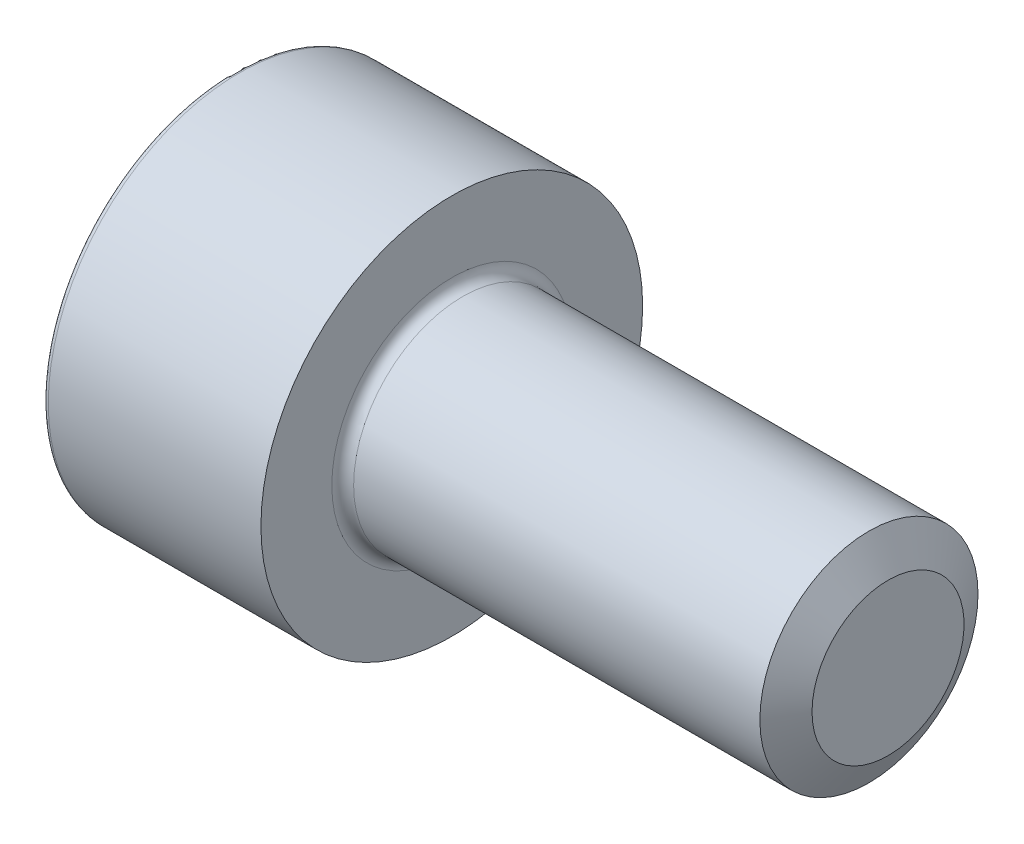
ISO-10303-21;
HEADER;
FILE_DESCRIPTION(('STEP AP214'),'2;1');
FILE_NAME('part.step','',(''),(''),'','','');
FILE_SCHEMA(('AUTOMOTIVE_DESIGN { 1 0 10303 214 1 1 1 1 }'));
ENDSEC;
DATA;
#1=APPLICATION_CONTEXT('core data for automotive mechanical design processes');
#2=APPLICATION_PROTOCOL_DEFINITION('international standard','automotive_design',2000,#1);
#3=PRODUCT_CONTEXT('',#1,'mechanical');
#4=PRODUCT('Part','Part','',(#3));
#5=PRODUCT_RELATED_PRODUCT_CATEGORY('part','',(#4));
#6=PRODUCT_DEFINITION_FORMATION('','',#4);
#7=PRODUCT_DEFINITION_CONTEXT('part definition',#1,'design');
#8=PRODUCT_DEFINITION('design','',#6,#7);
#9=PRODUCT_DEFINITION_SHAPE('','',#8);
#10=(LENGTH_UNIT() NAMED_UNIT(*) SI_UNIT(.MILLI.,.METRE.));
#11=(NAMED_UNIT(*) PLANE_ANGLE_UNIT() SI_UNIT($,.RADIAN.));
#12=(NAMED_UNIT(*) SI_UNIT($,.STERADIAN.) SOLID_ANGLE_UNIT());
#13=UNCERTAINTY_MEASURE_WITH_UNIT(LENGTH_MEASURE(1.E-05),#10,'distance_accuracy_value','');
#14=(GEOMETRIC_REPRESENTATION_CONTEXT(3) GLOBAL_UNCERTAINTY_ASSIGNED_CONTEXT((#13)) GLOBAL_UNIT_ASSIGNED_CONTEXT((#10,
#11,#12)) REPRESENTATION_CONTEXT('',''));
#15=CARTESIAN_POINT('',(0.,0.,0.));
#16=DIRECTION('',(0.,0.,1.));
#17=DIRECTION('',(1.,0.,0.));
#18=AXIS2_PLACEMENT_3D('',#15,#16,#17);
#19=CARTESIAN_POINT('',(12.,2.,0.));
#20=DIRECTION('',(-1.,0.,0.));
#21=DIRECTION('',(0.,0.,1.));
#22=AXIS2_PLACEMENT_3D('',#19,#20,#21);
#23=PLANE('',#22);
#24=CARTESIAN_POINT('',(12.,0.,0.));
#25=DIRECTION('',(-1.,0.,0.));
#26=DIRECTION('',(0.,0.,1.));
#27=AXIS2_PLACEMENT_3D('',#24,#25,#26);
#28=CIRCLE('',#27,1.3938);
#29=CARTESIAN_POINT('',(12.,0.,1.3938));
#30=VERTEX_POINT('',#29);
#31=EDGE_CURVE('E165',#30,#30,#28,.T.);
#32=ORIENTED_EDGE('',*,*,#31,.F.);
#33=EDGE_LOOP('',(#32));
#34=FACE_BOUND('',#33,.T.);
#35=ADVANCED_FACE('F17',(#34),#23,.F.);
#36=CARTESIAN_POINT('',(2.,1.48956369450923,2.58));
#37=DIRECTION('',(-1.,0.,0.));
#38=DIRECTION('',(0.,0.,1.));
#39=AXIS2_PLACEMENT_3D('',#36,#37,#38);
#40=PLANE('',#39);
#41=DIRECTION('',(0.,0.866025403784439,0.5));
#42=VECTOR('',#41,1.);
#43=CARTESIAN_POINT('',(2.,-1.48956369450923,0.86));
#44=LINE('',#43,#42);
#45=CARTESIAN_POINT('',(2.,-1.48956369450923,0.86));
#46=VERTEX_POINT('',#45);
#47=CARTESIAN_POINT('',(2.,0.,1.72));
#48=VERTEX_POINT('',#47);
#49=EDGE_CURVE('E96',#46,#48,#44,.T.);
#50=ORIENTED_EDGE('',*,*,#49,.T.);
#51=DIRECTION('',(0.,0.866025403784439,-0.5));
#52=VECTOR('',#51,1.);
#53=CARTESIAN_POINT('',(2.,0.,1.72));
#54=LINE('',#53,#52);
#55=CARTESIAN_POINT('',(2.,1.48956369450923,0.86));
#56=VERTEX_POINT('',#55);
#57=EDGE_CURVE('E11',#48,#56,#54,.T.);
#58=ORIENTED_EDGE('',*,*,#57,.T.);
#59=DIRECTION('',(0.,0.,-1.));
#60=VECTOR('',#59,1.);
#61=CARTESIAN_POINT('',(2.,1.48956369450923,0.86));
#62=LINE('',#61,#60);
#63=CARTESIAN_POINT('',(2.,1.48956369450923,-0.86));
#64=VERTEX_POINT('',#63);
#65=EDGE_CURVE('E44',#56,#64,#62,.T.);
#66=ORIENTED_EDGE('',*,*,#65,.T.);
#67=DIRECTION('',(0.,-0.866025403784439,-0.5));
#68=VECTOR('',#67,1.);
#69=CARTESIAN_POINT('',(2.,1.48956369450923,-0.86));
#70=LINE('',#69,#68);
#71=CARTESIAN_POINT('',(2.,0.,-1.72));
#72=VERTEX_POINT('',#71);
#73=EDGE_CURVE('E149',#64,#72,#70,.T.);
#74=ORIENTED_EDGE('',*,*,#73,.T.);
#75=DIRECTION('',(0.,-0.866025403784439,0.5));
#76=VECTOR('',#75,1.);
#77=CARTESIAN_POINT('',(2.,0.,-1.72));
#78=LINE('',#77,#76);
#79=CARTESIAN_POINT('',(2.,-1.48956369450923,-0.86));
#80=VERTEX_POINT('',#79);
#81=EDGE_CURVE('E143',#72,#80,#78,.T.);
#82=ORIENTED_EDGE('',*,*,#81,.T.);
#83=DIRECTION('',(0.,0.,1.));
#84=VECTOR('',#83,1.);
#85=CARTESIAN_POINT('',(2.,-1.48956369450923,-0.86));
#86=LINE('',#85,#84);
#87=EDGE_CURVE('E137',#80,#46,#86,.T.);
#88=ORIENTED_EDGE('',*,*,#87,.T.);
#89=EDGE_LOOP('',(#50,#58,#66,#74,#82,#88));
#90=FACE_BOUND('',#89,.T.);
#91=ADVANCED_FACE('F187',(#90),#40,.T.);
#92=CARTESIAN_POINT('',(2.,0.,1.72));
#93=DIRECTION('',(0.,0.5,0.866025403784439));
#94=DIRECTION('',(1.,0.,0.));
#95=AXIS2_PLACEMENT_3D('',#92,#93,#94);
#96=PLANE('',#95);
#97=DIRECTION('',(0.,0.866025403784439,-0.5));
#98=VECTOR('',#97,1.);
#99=CARTESIAN_POINT('',(0.,0.,1.72));
#100=LINE('',#99,#98);
#101=CARTESIAN_POINT('',(0.,0.,1.72));
#102=VERTEX_POINT('',#101);
#103=CARTESIAN_POINT('',(0.,1.48956369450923,0.86));
#104=VERTEX_POINT('',#103);
#105=EDGE_CURVE('E92',#102,#104,#100,.T.);
#106=ORIENTED_EDGE('',*,*,#105,.T.);
#107=DIRECTION('',(-1.,0.,0.));
#108=VECTOR('',#107,1.);
#109=CARTESIAN_POINT('',(2.,1.48956369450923,0.86));
#110=LINE('',#109,#108);
#111=EDGE_CURVE('E25',#56,#104,#110,.T.);
#112=ORIENTED_EDGE('',*,*,#111,.F.);
#113=ORIENTED_EDGE('',*,*,#57,.F.);
#114=DIRECTION('',(-1.,0.,0.));
#115=VECTOR('',#114,1.);
#116=CARTESIAN_POINT('',(2.,0.,1.72));
#117=LINE('',#116,#115);
#118=EDGE_CURVE('E88',#48,#102,#117,.T.);
#119=ORIENTED_EDGE('',*,*,#118,.T.);
#120=EDGE_LOOP('',(#106,#112,#113,#119));
#121=FACE_BOUND('',#120,.T.);
#122=ADVANCED_FACE('F90',(#121),#96,.F.);
#123=CARTESIAN_POINT('',(2.,1.48956369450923,0.86));
#124=DIRECTION('',(0.,1.,0.));
#125=DIRECTION('',(1.,0.,0.));
#126=AXIS2_PLACEMENT_3D('',#123,#124,#125);
#127=PLANE('',#126);
#128=DIRECTION('',(0.,0.,-1.));
#129=VECTOR('',#128,1.);
#130=CARTESIAN_POINT('',(0.,1.48956369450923,0.86));
#131=LINE('',#130,#129);
#132=CARTESIAN_POINT('',(0.,1.48956369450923,-0.86));
#133=VERTEX_POINT('',#132);
#134=EDGE_CURVE('E97',#104,#133,#131,.T.);
#135=ORIENTED_EDGE('',*,*,#134,.T.);
#136=DIRECTION('',(-1.,0.,0.));
#137=VECTOR('',#136,1.);
#138=CARTESIAN_POINT('',(2.,1.48956369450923,-0.86));
#139=LINE('',#138,#137);
#140=EDGE_CURVE('E151',#64,#133,#139,.T.);
#141=ORIENTED_EDGE('',*,*,#140,.F.);
#142=ORIENTED_EDGE('',*,*,#65,.F.);
#143=ORIENTED_EDGE('',*,*,#111,.T.);
#144=EDGE_LOOP('',(#135,#141,#142,#143));
#145=FACE_BOUND('',#144,.T.);
#146=ADVANCED_FACE('F191',(#145),#127,.F.);
#147=CARTESIAN_POINT('',(2.,1.48956369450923,-0.86));
#148=DIRECTION('',(0.,0.5,-0.866025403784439));
#149=DIRECTION('',(-1.,0.,0.));
#150=AXIS2_PLACEMENT_3D('',#147,#148,#149);
#151=PLANE('',#150);
#152=DIRECTION('',(0.,-0.866025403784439,-0.5));
#153=VECTOR('',#152,1.);
#154=CARTESIAN_POINT('',(0.,1.48956369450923,-0.86));
#155=LINE('',#154,#153);
#156=CARTESIAN_POINT('',(0.,0.,-1.72));
#157=VERTEX_POINT('',#156);
#158=EDGE_CURVE('E131',#133,#157,#155,.T.);
#159=ORIENTED_EDGE('',*,*,#158,.T.);
#160=DIRECTION('',(-1.,0.,0.));
#161=VECTOR('',#160,1.);
#162=CARTESIAN_POINT('',(2.,0.,-1.72));
#163=LINE('',#162,#161);
#164=EDGE_CURVE('E146',#72,#157,#163,.T.);
#165=ORIENTED_EDGE('',*,*,#164,.F.);
#166=ORIENTED_EDGE('',*,*,#73,.F.);
#167=ORIENTED_EDGE('',*,*,#140,.T.);
#168=EDGE_LOOP('',(#159,#165,#166,#167));
#169=FACE_BOUND('',#168,.T.);
#170=ADVANCED_FACE('F190',(#169),#151,.F.);
#171=CARTESIAN_POINT('',(2.,0.,-1.72));
#172=DIRECTION('',(0.,-0.5,-0.866025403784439));
#173=DIRECTION('',(0.,-0.866025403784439,0.5));
#174=AXIS2_PLACEMENT_3D('',#171,#172,#173);
#175=PLANE('',#174);
#176=DIRECTION('',(0.,-0.866025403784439,0.5));
#177=VECTOR('',#176,1.);
#178=CARTESIAN_POINT('',(0.,0.,-1.72));
#179=LINE('',#178,#177);
#180=CARTESIAN_POINT('',(0.,-1.48956369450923,-0.86));
#181=VERTEX_POINT('',#180);
#182=EDGE_CURVE('E130',#157,#181,#179,.T.);
#183=ORIENTED_EDGE('',*,*,#182,.T.);
#184=DIRECTION('',(-1.,0.,0.));
#185=VECTOR('',#184,1.);
#186=CARTESIAN_POINT('',(2.,-1.48956369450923,-0.86));
#187=LINE('',#186,#185);
#188=EDGE_CURVE('E140',#80,#181,#187,.T.);
#189=ORIENTED_EDGE('',*,*,#188,.F.);
#190=ORIENTED_EDGE('',*,*,#81,.F.);
#191=ORIENTED_EDGE('',*,*,#164,.T.);
#192=EDGE_LOOP('',(#183,#189,#190,#191));
#193=FACE_BOUND('',#192,.T.);
#194=ADVANCED_FACE('F181',(#193),#175,.F.);
#195=CARTESIAN_POINT('',(2.,-1.48956369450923,-0.86));
#196=DIRECTION('',(0.,-1.,0.));
#197=DIRECTION('',(0.,0.,-1.));
#198=AXIS2_PLACEMENT_3D('',#195,#196,#197);
#199=PLANE('',#198);
#200=DIRECTION('',(0.,0.,1.));
#201=VECTOR('',#200,1.);
#202=CARTESIAN_POINT('',(0.,-1.48956369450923,-0.86));
#203=LINE('',#202,#201);
#204=CARTESIAN_POINT('',(0.,-1.48956369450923,0.86));
#205=VERTEX_POINT('',#204);
#206=EDGE_CURVE('E108',#181,#205,#203,.T.);
#207=ORIENTED_EDGE('',*,*,#206,.T.);
#208=DIRECTION('',(-1.,0.,0.));
#209=VECTOR('',#208,1.);
#210=CARTESIAN_POINT('',(2.,-1.48956369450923,0.86));
#211=LINE('',#210,#209);
#212=EDGE_CURVE('E103',#46,#205,#211,.T.);
#213=ORIENTED_EDGE('',*,*,#212,.F.);
#214=ORIENTED_EDGE('',*,*,#87,.F.);
#215=ORIENTED_EDGE('',*,*,#188,.T.);
#216=EDGE_LOOP('',(#207,#213,#214,#215));
#217=FACE_BOUND('',#216,.T.);
#218=ADVANCED_FACE('F186',(#217),#199,.F.);
#219=CARTESIAN_POINT('',(2.,-1.48956369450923,0.86));
#220=DIRECTION('',(0.,-0.5,0.866025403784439));
#221=DIRECTION('',(-1.,0.,0.));
#222=AXIS2_PLACEMENT_3D('',#219,#220,#221);
#223=PLANE('',#222);
#224=DIRECTION('',(0.,0.866025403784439,0.5));
#225=VECTOR('',#224,1.);
#226=CARTESIAN_POINT('',(0.,-1.48956369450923,0.86));
#227=LINE('',#226,#225);
#228=EDGE_CURVE('E100',#205,#102,#227,.T.);
#229=ORIENTED_EDGE('',*,*,#228,.T.);
#230=ORIENTED_EDGE('',*,*,#118,.F.);
#231=ORIENTED_EDGE('',*,*,#49,.F.);
#232=ORIENTED_EDGE('',*,*,#212,.T.);
#233=EDGE_LOOP('',(#229,#230,#231,#232));
#234=FACE_BOUND('',#233,.T.);
#235=ADVANCED_FACE('F101',(#234),#223,.F.);
#236=CARTESIAN_POINT('',(4.,3.5,0.));
#237=DIRECTION('',(-1.,0.,0.));
#238=DIRECTION('',(0.,0.,1.));
#239=AXIS2_PLACEMENT_3D('',#236,#237,#238);
#240=PLANE('',#239);
#241=CARTESIAN_POINT('',(4.,0.,0.));
#242=DIRECTION('',(-1.,0.,0.));
#243=DIRECTION('',(0.,0.,1.));
#244=AXIS2_PLACEMENT_3D('',#241,#242,#243);
#245=CIRCLE('',#244,2.2);
#246=CARTESIAN_POINT('',(4.,0.,2.2));
#247=VERTEX_POINT('',#246);
#248=EDGE_CURVE('E172',#247,#247,#245,.T.);
#249=ORIENTED_EDGE('',*,*,#248,.T.);
#250=EDGE_LOOP('',(#249));
#251=FACE_BOUND('',#250,.T.);
#252=CARTESIAN_POINT('',(4.,0.,0.));
#253=DIRECTION('',(-1.,0.,0.));
#254=DIRECTION('',(0.,0.,1.));
#255=AXIS2_PLACEMENT_3D('',#252,#253,#254);
#256=CIRCLE('',#255,3.5);
#257=CARTESIAN_POINT('',(4.,0.,3.5));
#258=VERTEX_POINT('',#257);
#259=EDGE_CURVE('E116',#258,#258,#256,.T.);
#260=ORIENTED_EDGE('',*,*,#259,.F.);
#261=EDGE_LOOP('',(#260));
#262=FACE_BOUND('',#261,.T.);
#263=ADVANCED_FACE('F430',(#251,#262),#240,.F.);
#264=CARTESIAN_POINT('',(0.,0.,0.));
#265=DIRECTION('',(1.,0.,0.));
#266=DIRECTION('',(0.,1.,0.));
#267=AXIS2_PLACEMENT_3D('',#264,#265,#266);
#268=PLANE('',#267);
#269=ORIENTED_EDGE('',*,*,#105,.F.);
#270=ORIENTED_EDGE('',*,*,#228,.F.);
#271=ORIENTED_EDGE('',*,*,#206,.F.);
#272=ORIENTED_EDGE('',*,*,#182,.F.);
#273=ORIENTED_EDGE('',*,*,#158,.F.);
#274=ORIENTED_EDGE('',*,*,#134,.F.);
#275=EDGE_LOOP('',(#269,#270,#271,#272,#273,#274));
#276=FACE_BOUND('',#275,.T.);
#277=CARTESIAN_POINT('',(0.,0.,0.));
#278=DIRECTION('',(-1.,0.,0.));
#279=DIRECTION('',(0.,0.,-1.));
#280=AXIS2_PLACEMENT_3D('',#277,#278,#279);
#281=CIRCLE('',#280,3.4);
#282=CARTESIAN_POINT('',(0.,0.,-3.4));
#283=VERTEX_POINT('',#282);
#284=EDGE_CURVE('E229',#283,#283,#281,.T.);
#285=ORIENTED_EDGE('',*,*,#284,.T.);
#286=EDGE_LOOP('',(#285));
#287=FACE_BOUND('',#286,.T.);
#288=ADVANCED_FACE('F111',(#276,#287),#268,.F.);
#289=CARTESIAN_POINT('',(0.,0.,0.));
#290=DIRECTION('',(-1.,0.,0.));
#291=DIRECTION('',(0.,0.,1.));
#292=AXIS2_PLACEMENT_3D('',#289,#290,#291);
#293=CYLINDRICAL_SURFACE('',#292,2.);
#294=CARTESIAN_POINT('',(4.2,0.,0.));
#295=DIRECTION('',(-1.,0.,0.));
#296=DIRECTION('',(0.,0.,1.));
#297=AXIS2_PLACEMENT_3D('',#294,#295,#296);
#298=CIRCLE('',#297,2.);
#299=CARTESIAN_POINT('',(4.2,0.,2.));
#300=VERTEX_POINT('',#299);
#301=EDGE_CURVE('E123',#300,#300,#298,.T.);
#302=ORIENTED_EDGE('',*,*,#301,.F.);
#303=EDGE_LOOP('',(#302));
#304=FACE_BOUND('',#303,.T.);
#305=CARTESIAN_POINT('',(11.6500102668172,0.,0.));
#306=DIRECTION('',(-1.,0.,0.));
#307=DIRECTION('',(0.,0.,1.));
#308=AXIS2_PLACEMENT_3D('',#305,#306,#307);
#309=CIRCLE('',#308,2.);
#310=CARTESIAN_POINT('',(11.6500102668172,0.,2.));
#311=VERTEX_POINT('',#310);
#312=EDGE_CURVE('E168',#311,#311,#309,.T.);
#313=ORIENTED_EDGE('',*,*,#312,.T.);
#314=EDGE_LOOP('',(#313));
#315=FACE_BOUND('',#314,.T.);
#316=ADVANCED_FACE('F303',(#304,#315),#293,.T.);
#317=CARTESIAN_POINT('',(0.,0.,0.));
#318=DIRECTION('',(-1.,0.,0.));
#319=DIRECTION('',(0.,0.,1.));
#320=AXIS2_PLACEMENT_3D('',#317,#318,#319);
#321=CYLINDRICAL_SURFACE('',#320,3.5);
#322=CARTESIAN_POINT('',(0.1,0.,0.));
#323=DIRECTION('',(1.,0.,0.));
#324=DIRECTION('',(0.,0.,-1.));
#325=AXIS2_PLACEMENT_3D('',#322,#323,#324);
#326=CIRCLE('',#325,3.5);
#327=CARTESIAN_POINT('',(0.1,0.,-3.5));
#328=VERTEX_POINT('',#327);
#329=EDGE_CURVE('E216',#328,#328,#326,.T.);
#330=ORIENTED_EDGE('',*,*,#329,.T.);
#331=EDGE_LOOP('',(#330));
#332=FACE_BOUND('',#331,.T.);
#333=ORIENTED_EDGE('',*,*,#259,.T.);
#334=EDGE_LOOP('',(#333));
#335=FACE_BOUND('',#334,.T.);
#336=ADVANCED_FACE('F290',(#332,#335),#321,.T.);
#337=CARTESIAN_POINT('',(4.2,0.,0.));
#338=DIRECTION('',(-1.,0.,0.));
#339=DIRECTION('',(0.,0.,1.));
#340=AXIS2_PLACEMENT_3D('',#337,#338,#339);
#341=TOROIDAL_SURFACE('',#340,2.2,0.2);
#342=ORIENTED_EDGE('',*,*,#301,.T.);
#343=EDGE_LOOP('',(#342));
#344=FACE_BOUND('',#343,.T.);
#345=ORIENTED_EDGE('',*,*,#248,.F.);
#346=EDGE_LOOP('',(#345));
#347=FACE_BOUND('',#346,.T.);
#348=ADVANCED_FACE('F277',(#344,#347),#341,.F.);
#349=CARTESIAN_POINT('',(11.6500102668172,0.,0.));
#350=DIRECTION('',(-1.,0.,0.));
#351=DIRECTION('',(0.,0.,1.));
#352=AXIS2_PLACEMENT_3D('',#349,#350,#351);
#353=CONICAL_SURFACE('',#352,2.,1.0471975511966);
#354=ORIENTED_EDGE('',*,*,#312,.F.);
#355=EDGE_LOOP('',(#354));
#356=FACE_BOUND('',#355,.T.);
#357=ORIENTED_EDGE('',*,*,#31,.T.);
#358=EDGE_LOOP('',(#357));
#359=FACE_BOUND('',#358,.T.);
#360=ADVANCED_FACE('F263',(#356,#359),#353,.T.);
#361=CARTESIAN_POINT('',(0.1,0.,0.));
#362=DIRECTION('',(1.,0.,0.));
#363=DIRECTION('',(0.,0.,-1.));
#364=AXIS2_PLACEMENT_3D('',#361,#362,#363);
#365=TOROIDAL_SURFACE('',#364,3.4,0.1);
#366=ORIENTED_EDGE('',*,*,#329,.F.);
#367=EDGE_LOOP('',(#366));
#368=FACE_BOUND('',#367,.T.);
#369=ORIENTED_EDGE('',*,*,#284,.F.);
#370=EDGE_LOOP('',(#369));
#371=FACE_BOUND('',#370,.T.);
#372=ADVANCED_FACE('F257',(#368,#371),#365,.T.);
#373=CLOSED_SHELL('',(#35,#91,#122,#146,#170,#194,#218,#235,#263,#288,#316,#336,#348,#360,#372));
#374=MANIFOLD_SOLID_BREP('B1',#373);
#375=ADVANCED_BREP_SHAPE_REPRESENTATION('',(#18,#374),#14);
#376=SHAPE_DEFINITION_REPRESENTATION(#9,#375);
ENDSEC;
END-ISO-10303-21;
